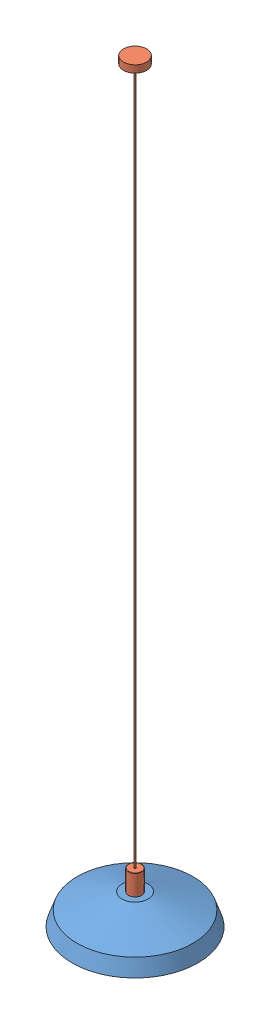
SolidWorks assembly Ensamblaje1.sldasm, configuration Predeterminado (file format 11000). Lengths in mm.
Overall size (435 2606.5 435).
2 component instances, 2 part files, 2 mates.
Components (placement in the parent):
- EVELYN-C3906-3D-1: EVELYN-C3906-3D.SLDPRT [Predeterminado] at origin size (435 105 435)
- CONJUNTO FLORON-B-81CON3913-1: CONJUNTO FLORON-B-81CON3913.SLDPRT [Predeterminado] at (0 52.5 0) size (80 2518.5 80)
Mates (geometry in assembly coordinates):
- Concéntrica1: concentric: cylinder of assembly; cylinder of assembly; cylinder of EVELYN-C3906-3D-1 through (0 42.5 0) axis (0 1 0) radius 20; cylinder of CONJUNTO FLORON-B-81CON3913-1 through (0 35.5 0) axis (0 1 0) radius 20
- Coincidente1: coincident: plane of assembly; plane of assembly; plane of EVELYN-C3906-3D-1 through (44.8623 51.7 0) normal (0 -1 0); plane of CONJUNTO FLORON-B-81CON3913-1 through (0 51.7 0) normal (0 1 0)
